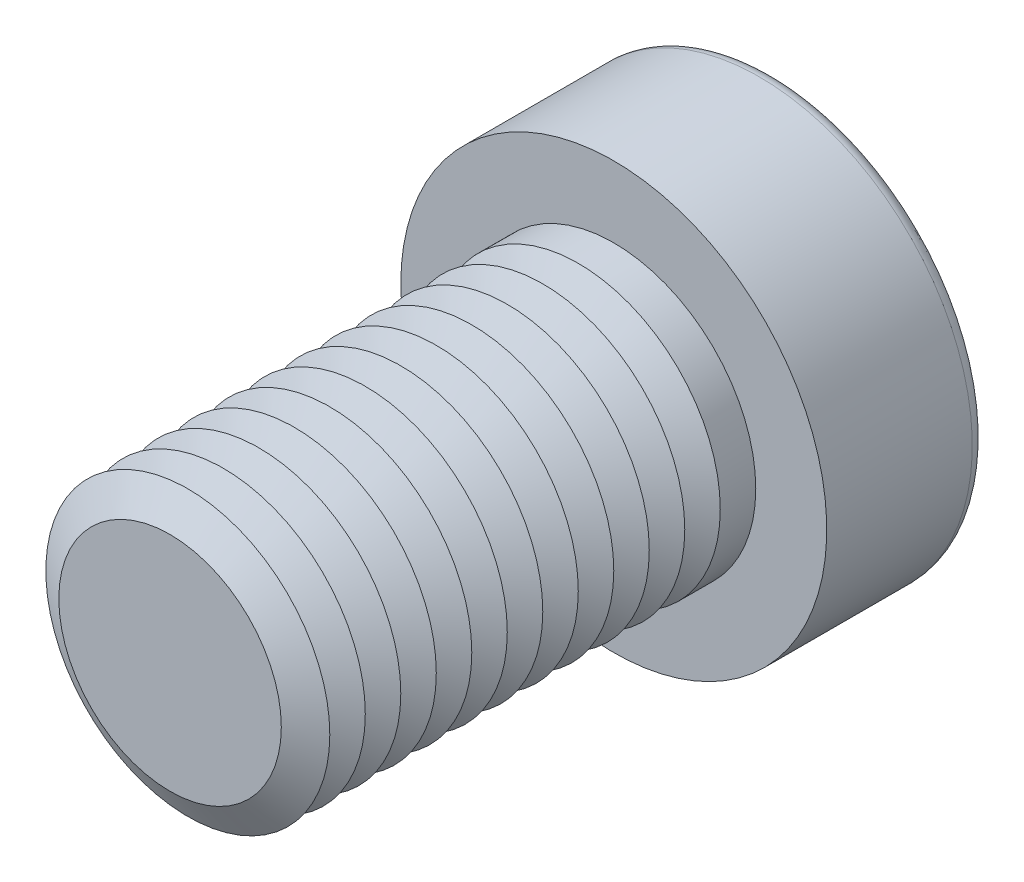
ISO-10303-21;
HEADER;
FILE_DESCRIPTION(('STEP AP214'),'2;1');
FILE_NAME('part.step','',(''),(''),'','','');
FILE_SCHEMA(('AUTOMOTIVE_DESIGN { 1 0 10303 214 1 1 1 1 }'));
ENDSEC;
DATA;
#1=APPLICATION_CONTEXT('core data for automotive mechanical design processes');
#2=APPLICATION_PROTOCOL_DEFINITION('international standard','automotive_design',2000,#1);
#3=PRODUCT_CONTEXT('',#1,'mechanical');
#4=PRODUCT('Part','Part','',(#3));
#5=PRODUCT_RELATED_PRODUCT_CATEGORY('part','',(#4));
#6=PRODUCT_DEFINITION_FORMATION('','',#4);
#7=PRODUCT_DEFINITION_CONTEXT('part definition',#1,'design');
#8=PRODUCT_DEFINITION('design','',#6,#7);
#9=PRODUCT_DEFINITION_SHAPE('','',#8);
#10=(LENGTH_UNIT() NAMED_UNIT(*) SI_UNIT(.MILLI.,.METRE.));
#11=(NAMED_UNIT(*) PLANE_ANGLE_UNIT() SI_UNIT($,.RADIAN.));
#12=(NAMED_UNIT(*) SI_UNIT($,.STERADIAN.) SOLID_ANGLE_UNIT());
#13=UNCERTAINTY_MEASURE_WITH_UNIT(LENGTH_MEASURE(1.E-05),#10,'distance_accuracy_value','');
#14=(GEOMETRIC_REPRESENTATION_CONTEXT(3) GLOBAL_UNCERTAINTY_ASSIGNED_CONTEXT((#13)) GLOBAL_UNIT_ASSIGNED_CONTEXT((#10,
#11,#12)) REPRESENTATION_CONTEXT('',''));
#15=CARTESIAN_POINT('',(0.,0.,0.));
#16=DIRECTION('',(0.,0.,1.));
#17=DIRECTION('',(1.,0.,0.));
#18=AXIS2_PLACEMENT_3D('',#15,#16,#17);
#19=CARTESIAN_POINT('',(0.,0.,18.));
#20=DIRECTION('',(0.,0.,1.));
#21=DIRECTION('',(1.,0.,0.));
#22=AXIS2_PLACEMENT_3D('',#19,#20,#21);
#23=CONICAL_SURFACE('',#22,8.,1.0471975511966);
#24=CARTESIAN_POINT('',(0.,0.,17.));
#25=DIRECTION('',(0.,0.,1.));
#26=DIRECTION('',(1.,0.,0.));
#27=AXIS2_PLACEMENT_3D('',#24,#25,#26);
#28=CIRCLE('',#27,6.26794919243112);
#29=CARTESIAN_POINT('',(6.26794919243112,0.,17.));
#30=VERTEX_POINT('',#29);
#31=EDGE_CURVE('E312',#30,#30,#28,.T.);
#32=ORIENTED_EDGE('',*,*,#31,.T.);
#33=EDGE_LOOP('',(#32));
#34=FACE_BOUND('',#33,.T.);
#35=CARTESIAN_POINT('',(0.,0.,18.));
#36=DIRECTION('',(0.,0.,1.));
#37=DIRECTION('',(1.,0.,0.));
#38=AXIS2_PLACEMENT_3D('',#35,#36,#37);
#39=CIRCLE('',#38,8.);
#40=CARTESIAN_POINT('',(8.,0.,18.));
#41=VERTEX_POINT('',#40);
#42=EDGE_CURVE('E315',#41,#41,#39,.T.);
#43=ORIENTED_EDGE('',*,*,#42,.F.);
#44=EDGE_LOOP('',(#43));
#45=FACE_BOUND('',#44,.T.);
#46=ADVANCED_FACE('F39',(#34,#45),#23,.T.);
#47=CARTESIAN_POINT('',(0.,0.,17.));
#48=DIRECTION('',(0.,0.,-1.));
#49=DIRECTION('',(-1.,0.,0.));
#50=AXIS2_PLACEMENT_3D('',#47,#48,#49);
#51=CONICAL_SURFACE('',#50,6.26794919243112,1.0471975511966);
#52=CARTESIAN_POINT('',(0.,0.,16.));
#53=DIRECTION('',(0.,0.,1.));
#54=DIRECTION('',(1.,0.,0.));
#55=AXIS2_PLACEMENT_3D('',#52,#53,#54);
#56=CIRCLE('',#55,8.);
#57=CARTESIAN_POINT('',(8.,0.,16.));
#58=VERTEX_POINT('',#57);
#59=EDGE_CURVE('E323',#58,#58,#56,.T.);
#60=ORIENTED_EDGE('',*,*,#59,.T.);
#61=EDGE_LOOP('',(#60));
#62=FACE_BOUND('',#61,.T.);
#63=ORIENTED_EDGE('',*,*,#31,.F.);
#64=EDGE_LOOP('',(#63));
#65=FACE_BOUND('',#64,.T.);
#66=ADVANCED_FACE('F244',(#62,#65),#51,.T.);
#67=CARTESIAN_POINT('',(0.,0.,25.));
#68=DIRECTION('',(0.,0.,1.));
#69=DIRECTION('',(1.,0.,0.));
#70=AXIS2_PLACEMENT_3D('',#67,#68,#69);
#71=PLANE('',#70);
#72=CARTESIAN_POINT('',(0.,0.,25.));
#73=DIRECTION('',(0.,0.,1.));
#74=DIRECTION('',(1.,0.,0.));
#75=AXIS2_PLACEMENT_3D('',#72,#73,#74);
#76=CIRCLE('',#75,6.26794919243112);
#77=CARTESIAN_POINT('',(6.26794919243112,0.,25.));
#78=VERTEX_POINT('',#77);
#79=EDGE_CURVE('E173',#78,#78,#76,.T.);
#80=ORIENTED_EDGE('',*,*,#79,.T.);
#81=EDGE_LOOP('',(#80));
#82=FACE_BOUND('',#81,.T.);
#83=ADVANCED_FACE('F250',(#82),#71,.T.);
#84=CARTESIAN_POINT('',(0.,0.,25.));
#85=DIRECTION('',(0.,0.,-1.));
#86=DIRECTION('',(-1.,0.,0.));
#87=AXIS2_PLACEMENT_3D('',#84,#85,#86);
#88=CONICAL_SURFACE('',#87,6.26794919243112,1.0471975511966);
#89=CARTESIAN_POINT('',(0.,0.,24.));
#90=DIRECTION('',(0.,0.,1.));
#91=DIRECTION('',(1.,0.,0.));
#92=AXIS2_PLACEMENT_3D('',#89,#90,#91);
#93=CIRCLE('',#92,8.);
#94=CARTESIAN_POINT('',(8.,0.,24.));
#95=VERTEX_POINT('',#94);
#96=EDGE_CURVE('E290',#95,#95,#93,.T.);
#97=ORIENTED_EDGE('',*,*,#96,.T.);
#98=EDGE_LOOP('',(#97));
#99=FACE_BOUND('',#98,.T.);
#100=ORIENTED_EDGE('',*,*,#79,.F.);
#101=EDGE_LOOP('',(#100));
#102=FACE_BOUND('',#101,.T.);
#103=ADVANCED_FACE('F198',(#99,#102),#88,.T.);
#104=CARTESIAN_POINT('',(0.,0.,24.));
#105=DIRECTION('',(0.,0.,1.));
#106=DIRECTION('',(1.,0.,0.));
#107=AXIS2_PLACEMENT_3D('',#104,#105,#106);
#108=CONICAL_SURFACE('',#107,8.,1.0471975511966);
#109=CARTESIAN_POINT('',(0.,0.,23.));
#110=DIRECTION('',(0.,0.,1.));
#111=DIRECTION('',(1.,0.,0.));
#112=AXIS2_PLACEMENT_3D('',#109,#110,#111);
#113=CIRCLE('',#112,6.26794919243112);
#114=CARTESIAN_POINT('',(6.26794919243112,0.,23.));
#115=VERTEX_POINT('',#114);
#116=EDGE_CURVE('E287',#115,#115,#113,.T.);
#117=ORIENTED_EDGE('',*,*,#116,.T.);
#118=EDGE_LOOP('',(#117));
#119=FACE_BOUND('',#118,.T.);
#120=ORIENTED_EDGE('',*,*,#96,.F.);
#121=EDGE_LOOP('',(#120));
#122=FACE_BOUND('',#121,.T.);
#123=ADVANCED_FACE('F276',(#119,#122),#108,.T.);
#124=CARTESIAN_POINT('',(0.,0.,23.));
#125=DIRECTION('',(0.,0.,-1.));
#126=DIRECTION('',(-1.,0.,0.));
#127=AXIS2_PLACEMENT_3D('',#124,#125,#126);
#128=CONICAL_SURFACE('',#127,6.26794919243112,1.0471975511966);
#129=CARTESIAN_POINT('',(0.,0.,22.));
#130=DIRECTION('',(0.,0.,1.));
#131=DIRECTION('',(1.,0.,0.));
#132=AXIS2_PLACEMENT_3D('',#129,#130,#131);
#133=CIRCLE('',#132,8.);
#134=CARTESIAN_POINT('',(8.,0.,22.));
#135=VERTEX_POINT('',#134);
#136=EDGE_CURVE('E299',#135,#135,#133,.T.);
#137=ORIENTED_EDGE('',*,*,#136,.T.);
#138=EDGE_LOOP('',(#137));
#139=FACE_BOUND('',#138,.T.);
#140=ORIENTED_EDGE('',*,*,#116,.F.);
#141=EDGE_LOOP('',(#140));
#142=FACE_BOUND('',#141,.T.);
#143=ADVANCED_FACE('F273',(#139,#142),#128,.T.);
#144=CARTESIAN_POINT('',(0.,0.,22.));
#145=DIRECTION('',(0.,0.,1.));
#146=DIRECTION('',(1.,0.,0.));
#147=AXIS2_PLACEMENT_3D('',#144,#145,#146);
#148=CONICAL_SURFACE('',#147,8.,1.0471975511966);
#149=CARTESIAN_POINT('',(0.,0.,21.));
#150=DIRECTION('',(0.,0.,1.));
#151=DIRECTION('',(1.,0.,0.));
#152=AXIS2_PLACEMENT_3D('',#149,#150,#151);
#153=CIRCLE('',#152,6.26794919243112);
#154=CARTESIAN_POINT('',(6.26794919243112,0.,21.));
#155=VERTEX_POINT('',#154);
#156=EDGE_CURVE('E292',#155,#155,#153,.T.);
#157=ORIENTED_EDGE('',*,*,#156,.T.);
#158=EDGE_LOOP('',(#157));
#159=FACE_BOUND('',#158,.T.);
#160=ORIENTED_EDGE('',*,*,#136,.F.);
#161=EDGE_LOOP('',(#160));
#162=FACE_BOUND('',#161,.T.);
#163=ADVANCED_FACE('F269',(#159,#162),#148,.T.);
#164=CARTESIAN_POINT('',(0.,0.,21.));
#165=DIRECTION('',(0.,0.,-1.));
#166=DIRECTION('',(-1.,0.,0.));
#167=AXIS2_PLACEMENT_3D('',#164,#165,#166);
#168=CONICAL_SURFACE('',#167,6.26794919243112,1.0471975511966);
#169=CARTESIAN_POINT('',(0.,0.,20.));
#170=DIRECTION('',(0.,0.,1.));
#171=DIRECTION('',(1.,0.,0.));
#172=AXIS2_PLACEMENT_3D('',#169,#170,#171);
#173=CIRCLE('',#172,8.);
#174=CARTESIAN_POINT('',(8.,0.,20.));
#175=VERTEX_POINT('',#174);
#176=EDGE_CURVE('E308',#175,#175,#173,.T.);
#177=ORIENTED_EDGE('',*,*,#176,.T.);
#178=EDGE_LOOP('',(#177));
#179=FACE_BOUND('',#178,.T.);
#180=ORIENTED_EDGE('',*,*,#156,.F.);
#181=EDGE_LOOP('',(#180));
#182=FACE_BOUND('',#181,.T.);
#183=ADVANCED_FACE('F265',(#179,#182),#168,.T.);
#184=CARTESIAN_POINT('',(0.,0.,20.));
#185=DIRECTION('',(0.,0.,1.));
#186=DIRECTION('',(1.,0.,0.));
#187=AXIS2_PLACEMENT_3D('',#184,#185,#186);
#188=CONICAL_SURFACE('',#187,8.,1.0471975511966);
#189=CARTESIAN_POINT('',(0.,0.,19.));
#190=DIRECTION('',(0.,0.,1.));
#191=DIRECTION('',(1.,0.,0.));
#192=AXIS2_PLACEMENT_3D('',#189,#190,#191);
#193=CIRCLE('',#192,6.26794919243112);
#194=CARTESIAN_POINT('',(6.26794919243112,0.,19.));
#195=VERTEX_POINT('',#194);
#196=EDGE_CURVE('E305',#195,#195,#193,.T.);
#197=ORIENTED_EDGE('',*,*,#196,.T.);
#198=EDGE_LOOP('',(#197));
#199=FACE_BOUND('',#198,.T.);
#200=ORIENTED_EDGE('',*,*,#176,.F.);
#201=EDGE_LOOP('',(#200));
#202=FACE_BOUND('',#201,.T.);
#203=ADVANCED_FACE('F261',(#199,#202),#188,.T.);
#204=CARTESIAN_POINT('',(0.,0.,19.));
#205=DIRECTION('',(0.,0.,-1.));
#206=DIRECTION('',(-1.,0.,0.));
#207=AXIS2_PLACEMENT_3D('',#204,#205,#206);
#208=CONICAL_SURFACE('',#207,6.26794919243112,1.0471975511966);
#209=ORIENTED_EDGE('',*,*,#42,.T.);
#210=EDGE_LOOP('',(#209));
#211=FACE_BOUND('',#210,.T.);
#212=ORIENTED_EDGE('',*,*,#196,.F.);
#213=EDGE_LOOP('',(#212));
#214=FACE_BOUND('',#213,.T.);
#215=ADVANCED_FACE('F257',(#211,#214),#208,.T.);
#216=CARTESIAN_POINT('',(0.,0.,16.));
#217=DIRECTION('',(0.,0.,1.));
#218=DIRECTION('',(1.,0.,0.));
#219=AXIS2_PLACEMENT_3D('',#216,#217,#218);
#220=CONICAL_SURFACE('',#219,8.,1.0471975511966);
#221=CARTESIAN_POINT('',(0.,0.,15.));
#222=DIRECTION('',(0.,0.,1.));
#223=DIRECTION('',(1.,0.,0.));
#224=AXIS2_PLACEMENT_3D('',#221,#222,#223);
#225=CIRCLE('',#224,6.26794919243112);
#226=CARTESIAN_POINT('',(6.26794919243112,0.,15.));
#227=VERTEX_POINT('',#226);
#228=EDGE_CURVE('E319',#227,#227,#225,.T.);
#229=ORIENTED_EDGE('',*,*,#228,.T.);
#230=EDGE_LOOP('',(#229));
#231=FACE_BOUND('',#230,.T.);
#232=ORIENTED_EDGE('',*,*,#59,.F.);
#233=EDGE_LOOP('',(#232));
#234=FACE_BOUND('',#233,.T.);
#235=ADVANCED_FACE('F260',(#231,#234),#220,.T.);
#236=CARTESIAN_POINT('',(0.,0.,15.));
#237=DIRECTION('',(0.,0.,-1.));
#238=DIRECTION('',(-1.,0.,0.));
#239=AXIS2_PLACEMENT_3D('',#236,#237,#238);
#240=CONICAL_SURFACE('',#239,6.26794919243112,1.0471975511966);
#241=CARTESIAN_POINT('',(0.,0.,14.));
#242=DIRECTION('',(0.,0.,1.));
#243=DIRECTION('',(1.,0.,0.));
#244=AXIS2_PLACEMENT_3D('',#241,#242,#243);
#245=CIRCLE('',#244,8.);
#246=CARTESIAN_POINT('',(8.,0.,14.));
#247=VERTEX_POINT('',#246);
#248=EDGE_CURVE('E331',#247,#247,#245,.T.);
#249=ORIENTED_EDGE('',*,*,#248,.T.);
#250=EDGE_LOOP('',(#249));
#251=FACE_BOUND('',#250,.T.);
#252=ORIENTED_EDGE('',*,*,#228,.F.);
#253=EDGE_LOOP('',(#252));
#254=FACE_BOUND('',#253,.T.);
#255=ADVANCED_FACE('F431',(#251,#254),#240,.T.);
#256=CARTESIAN_POINT('',(0.,0.,14.));
#257=DIRECTION('',(0.,0.,1.));
#258=DIRECTION('',(1.,0.,0.));
#259=AXIS2_PLACEMENT_3D('',#256,#257,#258);
#260=CONICAL_SURFACE('',#259,8.,1.0471975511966);
#261=CARTESIAN_POINT('',(0.,0.,13.));
#262=DIRECTION('',(0.,0.,1.));
#263=DIRECTION('',(1.,0.,0.));
#264=AXIS2_PLACEMENT_3D('',#261,#262,#263);
#265=CIRCLE('',#264,6.26794919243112);
#266=CARTESIAN_POINT('',(6.26794919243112,0.,13.));
#267=VERTEX_POINT('',#266);
#268=EDGE_CURVE('E327',#267,#267,#265,.T.);
#269=ORIENTED_EDGE('',*,*,#268,.T.);
#270=EDGE_LOOP('',(#269));
#271=FACE_BOUND('',#270,.T.);
#272=ORIENTED_EDGE('',*,*,#248,.F.);
#273=EDGE_LOOP('',(#272));
#274=FACE_BOUND('',#273,.T.);
#275=ADVANCED_FACE('F427',(#271,#274),#260,.T.);
#276=CARTESIAN_POINT('',(0.,0.,13.));
#277=DIRECTION('',(0.,0.,-1.));
#278=DIRECTION('',(-1.,0.,0.));
#279=AXIS2_PLACEMENT_3D('',#276,#277,#278);
#280=CONICAL_SURFACE('',#279,6.26794919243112,1.0471975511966);
#281=CARTESIAN_POINT('',(0.,0.,12.));
#282=DIRECTION('',(0.,0.,1.));
#283=DIRECTION('',(1.,0.,0.));
#284=AXIS2_PLACEMENT_3D('',#281,#282,#283);
#285=CIRCLE('',#284,8.);
#286=CARTESIAN_POINT('',(8.,0.,12.));
#287=VERTEX_POINT('',#286);
#288=EDGE_CURVE('E339',#287,#287,#285,.T.);
#289=ORIENTED_EDGE('',*,*,#288,.T.);
#290=EDGE_LOOP('',(#289));
#291=FACE_BOUND('',#290,.T.);
#292=ORIENTED_EDGE('',*,*,#268,.F.);
#293=EDGE_LOOP('',(#292));
#294=FACE_BOUND('',#293,.T.);
#295=ADVANCED_FACE('F423',(#291,#294),#280,.T.);
#296=CARTESIAN_POINT('',(0.,0.,12.));
#297=DIRECTION('',(0.,0.,1.));
#298=DIRECTION('',(1.,0.,0.));
#299=AXIS2_PLACEMENT_3D('',#296,#297,#298);
#300=CONICAL_SURFACE('',#299,8.,1.0471975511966);
#301=CARTESIAN_POINT('',(0.,0.,11.));
#302=DIRECTION('',(0.,0.,1.));
#303=DIRECTION('',(1.,0.,0.));
#304=AXIS2_PLACEMENT_3D('',#301,#302,#303);
#305=CIRCLE('',#304,6.26794919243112);
#306=CARTESIAN_POINT('',(6.26794919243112,0.,11.));
#307=VERTEX_POINT('',#306);
#308=EDGE_CURVE('E335',#307,#307,#305,.T.);
#309=ORIENTED_EDGE('',*,*,#308,.T.);
#310=EDGE_LOOP('',(#309));
#311=FACE_BOUND('',#310,.T.);
#312=ORIENTED_EDGE('',*,*,#288,.F.);
#313=EDGE_LOOP('',(#312));
#314=FACE_BOUND('',#313,.T.);
#315=ADVANCED_FACE('F419',(#311,#314),#300,.T.);
#316=CARTESIAN_POINT('',(0.,0.,11.));
#317=DIRECTION('',(0.,0.,-1.));
#318=DIRECTION('',(-1.,0.,0.));
#319=AXIS2_PLACEMENT_3D('',#316,#317,#318);
#320=CONICAL_SURFACE('',#319,6.26794919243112,1.0471975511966);
#321=CARTESIAN_POINT('',(0.,0.,9.99999999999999));
#322=DIRECTION('',(0.,0.,1.));
#323=DIRECTION('',(1.,0.,0.));
#324=AXIS2_PLACEMENT_3D('',#321,#322,#323);
#325=CIRCLE('',#324,8.);
#326=CARTESIAN_POINT('',(8.,0.,9.99999999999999));
#327=VERTEX_POINT('',#326);
#328=EDGE_CURVE('E347',#327,#327,#325,.T.);
#329=ORIENTED_EDGE('',*,*,#328,.T.);
#330=EDGE_LOOP('',(#329));
#331=FACE_BOUND('',#330,.T.);
#332=ORIENTED_EDGE('',*,*,#308,.F.);
#333=EDGE_LOOP('',(#332));
#334=FACE_BOUND('',#333,.T.);
#335=ADVANCED_FACE('F415',(#331,#334),#320,.T.);
#336=CARTESIAN_POINT('',(0.,0.,9.99999999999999));
#337=DIRECTION('',(0.,0.,1.));
#338=DIRECTION('',(1.,0.,0.));
#339=AXIS2_PLACEMENT_3D('',#336,#337,#338);
#340=CONICAL_SURFACE('',#339,8.,1.0471975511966);
#341=CARTESIAN_POINT('',(0.,0.,8.99999999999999));
#342=DIRECTION('',(0.,0.,1.));
#343=DIRECTION('',(1.,0.,0.));
#344=AXIS2_PLACEMENT_3D('',#341,#342,#343);
#345=CIRCLE('',#344,6.26794919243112);
#346=CARTESIAN_POINT('',(6.26794919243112,0.,8.99999999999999));
#347=VERTEX_POINT('',#346);
#348=EDGE_CURVE('E343',#347,#347,#345,.T.);
#349=ORIENTED_EDGE('',*,*,#348,.T.);
#350=EDGE_LOOP('',(#349));
#351=FACE_BOUND('',#350,.T.);
#352=ORIENTED_EDGE('',*,*,#328,.F.);
#353=EDGE_LOOP('',(#352));
#354=FACE_BOUND('',#353,.T.);
#355=ADVANCED_FACE('F411',(#351,#354),#340,.T.);
#356=CARTESIAN_POINT('',(0.,0.,8.99999999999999));
#357=DIRECTION('',(0.,0.,-1.));
#358=DIRECTION('',(-1.,0.,0.));
#359=AXIS2_PLACEMENT_3D('',#356,#357,#358);
#360=CONICAL_SURFACE('',#359,6.26794919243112,1.0471975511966);
#361=CARTESIAN_POINT('',(0.,0.,7.99999999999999));
#362=DIRECTION('',(0.,0.,1.));
#363=DIRECTION('',(1.,0.,0.));
#364=AXIS2_PLACEMENT_3D('',#361,#362,#363);
#365=CIRCLE('',#364,8.);
#366=CARTESIAN_POINT('',(8.,0.,7.99999999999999));
#367=VERTEX_POINT('',#366);
#368=EDGE_CURVE('E355',#367,#367,#365,.T.);
#369=ORIENTED_EDGE('',*,*,#368,.T.);
#370=EDGE_LOOP('',(#369));
#371=FACE_BOUND('',#370,.T.);
#372=ORIENTED_EDGE('',*,*,#348,.F.);
#373=EDGE_LOOP('',(#372));
#374=FACE_BOUND('',#373,.T.);
#375=ADVANCED_FACE('F407',(#371,#374),#360,.T.);
#376=CARTESIAN_POINT('',(0.,0.,7.99999999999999));
#377=DIRECTION('',(0.,0.,1.));
#378=DIRECTION('',(1.,0.,0.));
#379=AXIS2_PLACEMENT_3D('',#376,#377,#378);
#380=CONICAL_SURFACE('',#379,8.,1.0471975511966);
#381=CARTESIAN_POINT('',(0.,0.,6.99999999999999));
#382=DIRECTION('',(0.,0.,1.));
#383=DIRECTION('',(1.,0.,0.));
#384=AXIS2_PLACEMENT_3D('',#381,#382,#383);
#385=CIRCLE('',#384,6.26794919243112);
#386=CARTESIAN_POINT('',(6.26794919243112,0.,6.99999999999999));
#387=VERTEX_POINT('',#386);
#388=EDGE_CURVE('E351',#387,#387,#385,.T.);
#389=ORIENTED_EDGE('',*,*,#388,.T.);
#390=EDGE_LOOP('',(#389));
#391=FACE_BOUND('',#390,.T.);
#392=ORIENTED_EDGE('',*,*,#368,.F.);
#393=EDGE_LOOP('',(#392));
#394=FACE_BOUND('',#393,.T.);
#395=ADVANCED_FACE('F403',(#391,#394),#380,.T.);
#396=CARTESIAN_POINT('',(0.,0.,6.99999999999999));
#397=DIRECTION('',(0.,0.,-1.));
#398=DIRECTION('',(-1.,0.,0.));
#399=AXIS2_PLACEMENT_3D('',#396,#397,#398);
#400=CONICAL_SURFACE('',#399,6.26794919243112,1.0471975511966);
#401=CARTESIAN_POINT('',(0.,0.,5.99999999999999));
#402=DIRECTION('',(0.,0.,1.));
#403=DIRECTION('',(1.,0.,0.));
#404=AXIS2_PLACEMENT_3D('',#401,#402,#403);
#405=CIRCLE('',#404,8.);
#406=CARTESIAN_POINT('',(8.,0.,5.99999999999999));
#407=VERTEX_POINT('',#406);
#408=EDGE_CURVE('E363',#407,#407,#405,.T.);
#409=ORIENTED_EDGE('',*,*,#408,.T.);
#410=EDGE_LOOP('',(#409));
#411=FACE_BOUND('',#410,.T.);
#412=ORIENTED_EDGE('',*,*,#388,.F.);
#413=EDGE_LOOP('',(#412));
#414=FACE_BOUND('',#413,.T.);
#415=ADVANCED_FACE('F399',(#411,#414),#400,.T.);
#416=CARTESIAN_POINT('',(0.,0.,5.99999999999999));
#417=DIRECTION('',(0.,0.,1.));
#418=DIRECTION('',(1.,0.,0.));
#419=AXIS2_PLACEMENT_3D('',#416,#417,#418);
#420=CONICAL_SURFACE('',#419,8.,1.0471975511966);
#421=CARTESIAN_POINT('',(0.,0.,4.99999999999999));
#422=DIRECTION('',(0.,0.,1.));
#423=DIRECTION('',(1.,0.,0.));
#424=AXIS2_PLACEMENT_3D('',#421,#422,#423);
#425=CIRCLE('',#424,6.26794919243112);
#426=CARTESIAN_POINT('',(6.26794919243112,0.,4.99999999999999));
#427=VERTEX_POINT('',#426);
#428=EDGE_CURVE('E359',#427,#427,#425,.T.);
#429=ORIENTED_EDGE('',*,*,#428,.T.);
#430=EDGE_LOOP('',(#429));
#431=FACE_BOUND('',#430,.T.);
#432=ORIENTED_EDGE('',*,*,#408,.F.);
#433=EDGE_LOOP('',(#432));
#434=FACE_BOUND('',#433,.T.);
#435=ADVANCED_FACE('F394',(#431,#434),#420,.T.);
#436=CARTESIAN_POINT('',(0.,0.,4.99999999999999));
#437=DIRECTION('',(0.,0.,-1.));
#438=DIRECTION('',(-1.,0.,0.));
#439=AXIS2_PLACEMENT_3D('',#436,#437,#438);
#440=CONICAL_SURFACE('',#439,6.26794919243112,1.0471975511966);
#441=CARTESIAN_POINT('',(0.,0.,4.));
#442=DIRECTION('',(0.,0.,1.));
#443=DIRECTION('',(1.,0.,0.));
#444=AXIS2_PLACEMENT_3D('',#441,#442,#443);
#445=CIRCLE('',#444,8.);
#446=CARTESIAN_POINT('',(8.,0.,4.));
#447=VERTEX_POINT('',#446);
#448=EDGE_CURVE('E375',#447,#447,#445,.T.);
#449=ORIENTED_EDGE('',*,*,#448,.T.);
#450=EDGE_LOOP('',(#449));
#451=FACE_BOUND('',#450,.T.);
#452=ORIENTED_EDGE('',*,*,#428,.F.);
#453=EDGE_LOOP('',(#452));
#454=FACE_BOUND('',#453,.T.);
#455=ADVANCED_FACE('F380',(#451,#454),#440,.T.);
#456=CARTESIAN_POINT('',(0.,0.,4.));
#457=DIRECTION('',(0.,0.,1.));
#458=DIRECTION('',(1.,0.,0.));
#459=AXIS2_PLACEMENT_3D('',#456,#457,#458);
#460=CONICAL_SURFACE('',#459,8.,1.0471975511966);
#461=CARTESIAN_POINT('',(0.,0.,3.));
#462=DIRECTION('',(0.,0.,1.));
#463=DIRECTION('',(1.,0.,0.));
#464=AXIS2_PLACEMENT_3D('',#461,#462,#463);
#465=CIRCLE('',#464,6.26794919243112);
#466=CARTESIAN_POINT('',(6.26794919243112,0.,3.));
#467=VERTEX_POINT('',#466);
#468=EDGE_CURVE('E367',#467,#467,#465,.T.);
#469=ORIENTED_EDGE('',*,*,#468,.T.);
#470=EDGE_LOOP('',(#469));
#471=FACE_BOUND('',#470,.T.);
#472=ORIENTED_EDGE('',*,*,#448,.F.);
#473=EDGE_LOOP('',(#472));
#474=FACE_BOUND('',#473,.T.);
#475=ADVANCED_FACE('F383',(#471,#474),#460,.T.);
#476=CARTESIAN_POINT('',(0.,0.,3.));
#477=DIRECTION('',(0.,0.,-1.));
#478=DIRECTION('',(-1.,0.,0.));
#479=AXIS2_PLACEMENT_3D('',#476,#477,#478);
#480=CONICAL_SURFACE('',#479,6.26794919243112,1.0471975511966);
#481=CARTESIAN_POINT('',(0.,0.,1.99999999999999));
#482=DIRECTION('',(0.,0.,1.));
#483=DIRECTION('',(1.,0.,0.));
#484=AXIS2_PLACEMENT_3D('',#481,#482,#483);
#485=CIRCLE('',#484,8.);
#486=CARTESIAN_POINT('',(8.,0.,1.99999999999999));
#487=VERTEX_POINT('',#486);
#488=EDGE_CURVE('E371',#487,#487,#485,.T.);
#489=ORIENTED_EDGE('',*,*,#488,.T.);
#490=EDGE_LOOP('',(#489));
#491=FACE_BOUND('',#490,.T.);
#492=ORIENTED_EDGE('',*,*,#468,.F.);
#493=EDGE_LOOP('',(#492));
#494=FACE_BOUND('',#493,.T.);
#495=ADVANCED_FACE('F385',(#491,#494),#480,.T.);
#496=CARTESIAN_POINT('',(0.,0.,0.));
#497=DIRECTION('',(0.,0.,-1.));
#498=DIRECTION('',(-1.,0.,0.));
#499=AXIS2_PLACEMENT_3D('',#496,#497,#498);
#500=CONICAL_SURFACE('',#499,6.,1.0471975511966);
#501=CARTESIAN_POINT('',(0.,0.,3.46410161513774));
#502=VERTEX_POINT('',#501);
#503=VERTEX_LOOP('',#502);
#504=FACE_BOUND('',#503,.T.);
#505=CARTESIAN_POINT('',(0.,0.,0.));
#506=DIRECTION('',(0.,0.,-1.));
#507=DIRECTION('',(-1.,0.,0.));
#508=AXIS2_PLACEMENT_3D('',#505,#506,#507);
#509=CIRCLE('',#508,6.);
#510=CARTESIAN_POINT('',(-5.19615242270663,3.,0.));
#511=VERTEX_POINT('',#510);
#512=CARTESIAN_POINT('',(0.,6.,0.));
#513=VERTEX_POINT('',#512);
#514=EDGE_CURVE('E149',#511,#513,#509,.T.);
#515=ORIENTED_EDGE('',*,*,#514,.T.);
#516=CARTESIAN_POINT('',(0.,0.,0.));
#517=DIRECTION('',(0.,0.,-1.));
#518=DIRECTION('',(-1.,0.,0.));
#519=AXIS2_PLACEMENT_3D('',#516,#517,#518);
#520=CIRCLE('',#519,6.);
#521=CARTESIAN_POINT('',(5.19615242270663,3.,0.));
#522=VERTEX_POINT('',#521);
#523=EDGE_CURVE('E54',#513,#522,#520,.T.);
#524=ORIENTED_EDGE('',*,*,#523,.T.);
#525=CARTESIAN_POINT('',(5.19615242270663,-3.,0.));
#526=VERTEX_POINT('',#525);
#527=EDGE_CURVE('E875',#522,#526,#520,.T.);
#528=ORIENTED_EDGE('',*,*,#527,.T.);
#529=CARTESIAN_POINT('',(0.,-6.,0.));
#530=VERTEX_POINT('',#529);
#531=EDGE_CURVE('E873',#526,#530,#520,.T.);
#532=ORIENTED_EDGE('',*,*,#531,.T.);
#533=CARTESIAN_POINT('',(-5.19615242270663,-3.,0.));
#534=VERTEX_POINT('',#533);
#535=EDGE_CURVE('E868',#530,#534,#520,.T.);
#536=ORIENTED_EDGE('',*,*,#535,.T.);
#537=EDGE_CURVE('E866',#534,#511,#520,.T.);
#538=ORIENTED_EDGE('',*,*,#537,.T.);
#539=EDGE_LOOP('',(#515,#524,#528,#532,#536,#538));
#540=FACE_BOUND('',#539,.T.);
#541=ADVANCED_FACE('F200',(#504,#540),#500,.F.);
#542=CARTESIAN_POINT('',(0.,0.,0.));
#543=DIRECTION('',(0.,0.,-1.));
#544=DIRECTION('',(-1.,0.,0.));
#545=AXIS2_PLACEMENT_3D('',#542,#543,#544);
#546=PLANE('',#545);
#547=ORIENTED_EDGE('',*,*,#523,.F.);
#548=DIRECTION('',(1.,0.,0.));
#549=VECTOR('',#548,1.);
#550=CARTESIAN_POINT('',(-3.46410161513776,6.,0.));
#551=LINE('',#550,#549);
#552=CARTESIAN_POINT('',(3.46410161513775,6.,0.));
#553=VERTEX_POINT('',#552);
#554=EDGE_CURVE('E922',#513,#553,#551,.T.);
#555=ORIENTED_EDGE('',*,*,#554,.T.);
#556=DIRECTION('',(0.5,-0.866025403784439,0.));
#557=VECTOR('',#556,1.);
#558=CARTESIAN_POINT('',(3.46410161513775,6.,0.));
#559=LINE('',#558,#557);
#560=EDGE_CURVE('E155',#553,#522,#559,.T.);
#561=ORIENTED_EDGE('',*,*,#560,.T.);
#562=EDGE_LOOP('',(#547,#555,#561));
#563=FACE_BOUND('',#562,.T.);
#564=ADVANCED_FACE('F496',(#563),#546,.T.);
#565=ORIENTED_EDGE('',*,*,#527,.F.);
#566=CARTESIAN_POINT('',(6.92820323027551,0.,0.));
#567=VERTEX_POINT('',#566);
#568=EDGE_CURVE('E916',#522,#567,#559,.T.);
#569=ORIENTED_EDGE('',*,*,#568,.T.);
#570=DIRECTION('',(-0.5,-0.866025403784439,0.));
#571=VECTOR('',#570,1.);
#572=CARTESIAN_POINT('',(6.92820323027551,0.,0.));
#573=LINE('',#572,#571);
#574=EDGE_CURVE('E890',#567,#526,#573,.T.);
#575=ORIENTED_EDGE('',*,*,#574,.T.);
#576=EDGE_LOOP('',(#565,#569,#575));
#577=FACE_BOUND('',#576,.T.);
#578=ADVANCED_FACE('F506',(#577),#546,.T.);
#579=ORIENTED_EDGE('',*,*,#531,.F.);
#580=CARTESIAN_POINT('',(3.46410161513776,-6.,0.));
#581=VERTEX_POINT('',#580);
#582=EDGE_CURVE('E892',#526,#581,#573,.T.);
#583=ORIENTED_EDGE('',*,*,#582,.T.);
#584=DIRECTION('',(-1.,0.,0.));
#585=VECTOR('',#584,1.);
#586=CARTESIAN_POINT('',(3.46410161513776,-6.,0.));
#587=LINE('',#586,#585);
#588=EDGE_CURVE('E842',#581,#530,#587,.T.);
#589=ORIENTED_EDGE('',*,*,#588,.T.);
#590=EDGE_LOOP('',(#579,#583,#589));
#591=FACE_BOUND('',#590,.T.);
#592=ADVANCED_FACE('F516',(#591),#546,.T.);
#593=ORIENTED_EDGE('',*,*,#535,.F.);
#594=CARTESIAN_POINT('',(-3.46410161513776,-6.,0.));
#595=VERTEX_POINT('',#594);
#596=EDGE_CURVE('E886',#530,#595,#587,.T.);
#597=ORIENTED_EDGE('',*,*,#596,.T.);
#598=DIRECTION('',(-0.5,0.866025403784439,0.));
#599=VECTOR('',#598,1.);
#600=CARTESIAN_POINT('',(-3.46410161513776,-6.,0.));
#601=LINE('',#600,#599);
#602=EDGE_CURVE('E888',#595,#534,#601,.T.);
#603=ORIENTED_EDGE('',*,*,#602,.T.);
#604=EDGE_LOOP('',(#593,#597,#603));
#605=FACE_BOUND('',#604,.T.);
#606=ADVANCED_FACE('F524',(#605),#546,.T.);
#607=ORIENTED_EDGE('',*,*,#537,.F.);
#608=CARTESIAN_POINT('',(-6.92820323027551,0.,0.));
#609=VERTEX_POINT('',#608);
#610=EDGE_CURVE('E894',#534,#609,#601,.T.);
#611=ORIENTED_EDGE('',*,*,#610,.T.);
#612=DIRECTION('',(0.5,0.866025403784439,0.));
#613=VECTOR('',#612,1.);
#614=CARTESIAN_POINT('',(-6.92820323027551,0.,0.));
#615=LINE('',#614,#613);
#616=EDGE_CURVE('E158',#609,#511,#615,.T.);
#617=ORIENTED_EDGE('',*,*,#616,.T.);
#618=EDGE_LOOP('',(#607,#611,#617));
#619=FACE_BOUND('',#618,.T.);
#620=ADVANCED_FACE('F230',(#619),#546,.T.);
#621=ORIENTED_EDGE('',*,*,#514,.F.);
#622=CARTESIAN_POINT('',(-3.46410161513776,6.,0.));
#623=VERTEX_POINT('',#622);
#624=EDGE_CURVE('E901',#511,#623,#615,.T.);
#625=ORIENTED_EDGE('',*,*,#624,.T.);
#626=EDGE_CURVE('E918',#623,#513,#551,.T.);
#627=ORIENTED_EDGE('',*,*,#626,.T.);
#628=EDGE_LOOP('',(#621,#625,#627));
#629=FACE_BOUND('',#628,.T.);
#630=ADVANCED_FACE('F508',(#629),#546,.T.);
#631=CARTESIAN_POINT('',(-3.46410161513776,6.,0.));
#632=DIRECTION('',(0.,1.,0.));
#633=DIRECTION('',(0.,0.,1.));
#634=AXIS2_PLACEMENT_3D('',#631,#632,#633);
#635=PLANE('',#634);
#636=DIRECTION('',(0.,0.,-1.));
#637=VECTOR('',#636,1.);
#638=CARTESIAN_POINT('',(-3.46410161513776,6.,0.));
#639=LINE('',#638,#637);
#640=CARTESIAN_POINT('',(-3.46410161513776,6.,-9.));
#641=VERTEX_POINT('',#640);
#642=EDGE_CURVE('E147',#623,#641,#639,.T.);
#643=ORIENTED_EDGE('',*,*,#642,.T.);
#644=CARTESIAN_POINT('',(-9.04322275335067,6.,-10.0515506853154));
#645=CARTESIAN_POINT('',(-8.77229389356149,6.,-9.99107568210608));
#646=CARTESIAN_POINT('',(-8.50119215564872,6.,-9.93136093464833));
#647=CARTESIAN_POINT('',(-7.95855825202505,6.,-9.81386229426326));
#648=CARTESIAN_POINT('',(-7.68702606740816,6.,-9.75607848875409));
#649=CARTESIAN_POINT('',(-7.14318995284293,6.,-9.64279905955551));
#650=CARTESIAN_POINT('',(-6.87088551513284,6.,-9.58730586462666));
#651=CARTESIAN_POINT('',(-6.32570082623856,6.,-9.47922577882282));
#652=CARTESIAN_POINT('',(-6.05282058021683,6.,-9.42663886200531));
#653=CARTESIAN_POINT('',(-5.50875458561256,6.,-9.32550177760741));
#654=CARTESIAN_POINT('',(-5.23757463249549,6.,-9.27692059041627));
#655=CARTESIAN_POINT('',(-4.69446863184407,6.,-9.18413302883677));
#656=CARTESIAN_POINT('',(-4.42254260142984,6.,-9.13992655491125));
#657=CARTESIAN_POINT('',(-3.87790333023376,6.,-9.05690830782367));
#658=CARTESIAN_POINT('',(-3.6051902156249,6.,-9.0180957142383));
#659=CARTESIAN_POINT('',(-3.05890080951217,6.,-8.94703062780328));
#660=CARTESIAN_POINT('',(-2.7853245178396,6.,-8.91477813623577));
#661=CARTESIAN_POINT('',(-2.23425545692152,6.,-8.85776959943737));
#662=CARTESIAN_POINT('',(-1.95675335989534,6.,-8.83310236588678));
#663=CARTESIAN_POINT('',(-1.40107824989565,6.,-8.79298360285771));
#664=CARTESIAN_POINT('',(-1.12290525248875,6.,-8.77753186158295));
#665=CARTESIAN_POINT('',(-0.566293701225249,6.,-8.75674610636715));
#666=CARTESIAN_POINT('',(-0.287855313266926,6.,-8.75140773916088));
#667=CARTESIAN_POINT('',(0.269026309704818,6.,-8.75117360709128));
#668=CARTESIAN_POINT('',(0.547469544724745,6.,-8.75627785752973));
#669=CARTESIAN_POINT('',(1.10511819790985,6.,-8.77664719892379));
#670=CARTESIAN_POINT('',(1.38432206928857,6.,-8.79195380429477));
#671=CARTESIAN_POINT('',(1.94205759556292,6.,-8.83187108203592));
#672=CARTESIAN_POINT('',(2.22058923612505,6.,-8.85648195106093));
#673=CARTESIAN_POINT('',(2.77698779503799,6.,-8.91379497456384));
#674=CARTESIAN_POINT('',(3.05485416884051,6.,-8.94650233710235));
#675=CARTESIAN_POINT('',(3.60969614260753,6.,-9.01868375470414));
#676=CARTESIAN_POINT('',(3.88667174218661,6.,-9.0581578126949));
#677=CARTESIAN_POINT('',(4.44700464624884,6.,-9.14374886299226));
#678=CARTESIAN_POINT('',(4.73033933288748,6.,-9.190012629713));
#679=CARTESIAN_POINT('',(5.29620685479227,6.,-9.28723184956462));
#680=CARTESIAN_POINT('',(5.57873966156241,6.,-9.3381874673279));
#681=CARTESIAN_POINT('',(6.14313105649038,6.,-9.44386031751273));
#682=CARTESIAN_POINT('',(6.42498956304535,6.,-9.49857798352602));
#683=CARTESIAN_POINT('',(6.98810511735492,6.,-9.61103289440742));
#684=CARTESIAN_POINT('',(7.26936215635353,6.,-9.66877018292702));
#685=CARTESIAN_POINT('',(8.11254995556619,6.,-9.84563705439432));
#686=CARTESIAN_POINT('',(8.67372006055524,6.,-9.96838761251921));
#687=CARTESIAN_POINT('',(9.79457370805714,6.,-10.2202420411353));
#688=CARTESIAN_POINT('',(10.3542573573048,6.,-10.3493454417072));
#689=CARTESIAN_POINT('',(11.4657945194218,6.,-10.6103395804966));
#690=CARTESIAN_POINT('',(12.0176605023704,6.,-10.7421773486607));
#691=CARTESIAN_POINT('',(13.1206665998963,6.,-11.0089002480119));
#692=CARTESIAN_POINT('',(13.6718066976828,6.,-11.1437854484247));
#693=CARTESIAN_POINT('',(14.7727697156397,6.,-11.4155878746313));
#694=CARTESIAN_POINT('',(15.3225934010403,6.,-11.5525020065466));
#695=CARTESIAN_POINT('',(16.4217957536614,6.,-11.8280226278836));
#696=CARTESIAN_POINT('',(16.971174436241,6.,-11.9666290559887));
#697=CARTESIAN_POINT('',(17.5204019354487,6.,-12.1058251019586));
#698=B_SPLINE_CURVE_WITH_KNOTS('',3,(#644,#645,#646,#647,#648,#649,#650,#651,#652,#653,#654,
#655,#656,#657,#658,#659,#660,#661,#662,#663,#664,#665,#666,#667,#668,#669,#670,#671,#672,#673,
#674,#675,#676,#677,#678,#679,#680,#681,#682,#683,#684,#685,#686,#687,#688,#689,#690,#691,#692,
#693,#694,#695,#696,#697),.UNSPECIFIED.,.F.,.F.,(4,2,2,2,2,2,2,2,2,2,2,2,2,2,2,2,2,2,2,2,2,2,2,
2,2,2,4),(0.,0.832792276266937,1.6656222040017,2.49931362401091,3.33299760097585,
4.15946050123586,4.98590459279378,5.81222284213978,6.63854125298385,7.47419540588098,
8.30983035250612,9.14510552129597,9.98038191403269,10.8190780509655,11.6577919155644,
12.4970466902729,13.336301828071,14.1975135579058,15.0587555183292,15.9200969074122,
16.7814507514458,18.5047000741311,20.2278221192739,21.929995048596,23.6322066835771,
25.3320460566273,27.0318240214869),.UNSPECIFIED.);
#699=CARTESIAN_POINT('',(3.46410161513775,6.,-9.));
#700=VERTEX_POINT('',#699);
#701=EDGE_CURVE('E124',#641,#700,#698,.T.);
#702=ORIENTED_EDGE('',*,*,#701,.T.);
#703=DIRECTION('',(0.,0.,-1.));
#704=VECTOR('',#703,1.);
#705=CARTESIAN_POINT('',(3.46410161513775,6.,0.));
#706=LINE('',#705,#704);
#707=EDGE_CURVE('E143',#553,#700,#706,.T.);
#708=ORIENTED_EDGE('',*,*,#707,.F.);
#709=ORIENTED_EDGE('',*,*,#554,.F.);
#710=ORIENTED_EDGE('',*,*,#626,.F.);
#711=EDGE_LOOP('',(#643,#702,#708,#709,#710));
#712=FACE_BOUND('',#711,.T.);
#713=ADVANCED_FACE('F141',(#712),#635,.F.);
#714=CARTESIAN_POINT('',(3.46410161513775,6.,0.));
#715=DIRECTION('',(0.866025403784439,0.5,0.));
#716=DIRECTION('',(-0.5,0.866025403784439,0.));
#717=AXIS2_PLACEMENT_3D('',#714,#715,#716);
#718=PLANE('',#717);
#719=ORIENTED_EDGE('',*,*,#707,.T.);
#720=CARTESIAN_POINT('',(3.46398614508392,6.0002,-9.00003094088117));
#721=CARTESIAN_POINT('',(3.60785114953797,5.75101850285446,-8.96146591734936));
#722=CARTESIAN_POINT('',(3.75197700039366,5.5013852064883,-8.92645521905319));
#723=CARTESIAN_POINT('',(4.0407377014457,5.00123700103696,-8.86494467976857));
#724=CARTESIAN_POINT('',(4.18537273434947,4.75072177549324,-8.83844829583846));
#725=CARTESIAN_POINT('',(4.47427486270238,4.25032861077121,-8.79551324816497));
#726=CARTESIAN_POINT('',(4.61854000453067,4.00045405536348,-8.77902338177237));
#727=CARTESIAN_POINT('',(4.90725426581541,3.5003862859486,-8.75691215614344));
#728=CARTESIAN_POINT('',(5.05170334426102,3.2501931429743,-8.75128869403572));
#729=CARTESIAN_POINT('',(5.34060150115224,2.7498068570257,-8.75128869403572));
#730=CARTESIAN_POINT('',(5.48505057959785,2.4996137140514,-8.75691215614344));
#731=CARTESIAN_POINT('',(5.77376484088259,1.99954594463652,-8.77902338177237));
#732=CARTESIAN_POINT('',(5.91802998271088,1.74967138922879,-8.79551324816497));
#733=CARTESIAN_POINT('',(6.20693211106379,1.24927822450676,-8.83844829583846));
#734=CARTESIAN_POINT('',(6.35156714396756,0.998762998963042,-8.86494467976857));
#735=CARTESIAN_POINT('',(6.6403278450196,0.498614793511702,-8.92645521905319));
#736=CARTESIAN_POINT('',(6.78445369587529,0.248981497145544,-8.96146591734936));
#737=CARTESIAN_POINT('',(6.92831870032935,-0.000199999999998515,-9.00003094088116));
#738=B_SPLINE_CURVE_WITH_KNOTS('',3,(#720,#721,#722,#723,#724,#725,#726,#727,#728,#729,#730,
#731,#732,#733,#734,#735,#736,#737),.UNSPECIFIED.,.F.,.F.,(4,2,2,2,2,2,2,2,4),(0.,
0.870954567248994,1.74226232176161,2.60907321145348,3.47571633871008,4.34235946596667,
5.20917035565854,6.08047811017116,6.95143267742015),.UNSPECIFIED.);
#739=CARTESIAN_POINT('',(6.92820323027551,0.,-9.));
#740=VERTEX_POINT('',#739);
#741=EDGE_CURVE('E11',#700,#740,#738,.T.);
#742=ORIENTED_EDGE('',*,*,#741,.T.);
#743=DIRECTION('',(0.,0.,-1.));
#744=VECTOR('',#743,1.);
#745=CARTESIAN_POINT('',(6.92820323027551,0.,0.));
#746=LINE('',#745,#744);
#747=EDGE_CURVE('E157',#567,#740,#746,.T.);
#748=ORIENTED_EDGE('',*,*,#747,.F.);
#749=ORIENTED_EDGE('',*,*,#568,.F.);
#750=ORIENTED_EDGE('',*,*,#560,.F.);
#751=EDGE_LOOP('',(#719,#742,#748,#749,#750));
#752=FACE_BOUND('',#751,.T.);
#753=ADVANCED_FACE('F152',(#752),#718,.F.);
#754=CARTESIAN_POINT('',(6.92820323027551,0.,0.));
#755=DIRECTION('',(0.866025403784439,-0.5,0.));
#756=DIRECTION('',(0.5,0.866025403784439,0.));
#757=AXIS2_PLACEMENT_3D('',#754,#755,#756);
#758=PLANE('',#757);
#759=ORIENTED_EDGE('',*,*,#747,.T.);
#760=CARTESIAN_POINT('',(6.92831870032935,0.000200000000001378,-9.00003094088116));
#761=CARTESIAN_POINT('',(6.78445369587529,-0.248981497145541,-8.96146591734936));
#762=CARTESIAN_POINT('',(6.6403278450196,-0.498614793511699,-8.92645521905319));
#763=CARTESIAN_POINT('',(6.35156714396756,-0.998762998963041,-8.86494467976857));
#764=CARTESIAN_POINT('',(6.20693211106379,-1.24927822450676,-8.83844829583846));
#765=CARTESIAN_POINT('',(5.91802998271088,-1.74967138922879,-8.79551324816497));
#766=CARTESIAN_POINT('',(5.77376484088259,-1.99954594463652,-8.77902338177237));
#767=CARTESIAN_POINT('',(5.48505057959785,-2.4996137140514,-8.75691215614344));
#768=CARTESIAN_POINT('',(5.34060150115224,-2.7498068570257,-8.75128869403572));
#769=CARTESIAN_POINT('',(5.05170334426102,-3.2501931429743,-8.75128869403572));
#770=CARTESIAN_POINT('',(4.90725426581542,-3.50038628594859,-8.75691215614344));
#771=CARTESIAN_POINT('',(4.61854000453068,-4.00045405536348,-8.77902338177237));
#772=CARTESIAN_POINT('',(4.47427486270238,-4.25032861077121,-8.79551324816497));
#773=CARTESIAN_POINT('',(4.18537273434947,-4.75072177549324,-8.83844829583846));
#774=CARTESIAN_POINT('',(4.04073770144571,-5.00123700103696,-8.86494467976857));
#775=CARTESIAN_POINT('',(3.75197700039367,-5.5013852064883,-8.92645521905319));
#776=CARTESIAN_POINT('',(3.60785114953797,-5.75101850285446,-8.96146591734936));
#777=CARTESIAN_POINT('',(3.46398614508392,-6.0002,-9.00003094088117));
#778=B_SPLINE_CURVE_WITH_KNOTS('',3,(#760,#761,#762,#763,#764,#765,#766,#767,#768,#769,#770,
#771,#772,#773,#774,#775,#776,#777),.UNSPECIFIED.,.F.,.F.,(4,2,2,2,2,2,2,2,4),(0.,
0.870954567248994,1.74226232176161,2.60907321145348,3.47571633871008,4.34235946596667,
5.20917035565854,6.08047811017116,6.95143267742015),.UNSPECIFIED.);
#779=CARTESIAN_POINT('',(3.46410161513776,-6.,-9.));
#780=VERTEX_POINT('',#779);
#781=EDGE_CURVE('E172',#740,#780,#778,.T.);
#782=ORIENTED_EDGE('',*,*,#781,.T.);
#783=DIRECTION('',(0.,0.,-1.));
#784=VECTOR('',#783,1.);
#785=CARTESIAN_POINT('',(3.46410161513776,-6.,0.));
#786=LINE('',#785,#784);
#787=EDGE_CURVE('E837',#581,#780,#786,.T.);
#788=ORIENTED_EDGE('',*,*,#787,.F.);
#789=ORIENTED_EDGE('',*,*,#582,.F.);
#790=ORIENTED_EDGE('',*,*,#574,.F.);
#791=EDGE_LOOP('',(#759,#782,#788,#789,#790));
#792=FACE_BOUND('',#791,.T.);
#793=ADVANCED_FACE('F190',(#792),#758,.F.);
#794=CARTESIAN_POINT('',(3.46410161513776,-6.,0.));
#795=DIRECTION('',(0.,-1.,0.));
#796=DIRECTION('',(1.,0.,0.));
#797=AXIS2_PLACEMENT_3D('',#794,#795,#796);
#798=PLANE('',#797);
#799=ORIENTED_EDGE('',*,*,#787,.T.);
#800=CARTESIAN_POINT('',(-9.04322275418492,-6.,-10.0515506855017));
#801=CARTESIAN_POINT('',(-8.77229389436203,-6.,-9.99107568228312));
#802=CARTESIAN_POINT('',(-8.50119215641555,-6.,-9.93136093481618));
#803=CARTESIAN_POINT('',(-7.95855825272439,-6.,-9.81386229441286));
#804=CARTESIAN_POINT('',(-7.68702606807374,-6.,-9.75607848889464));
#805=CARTESIAN_POINT('',(-7.1431899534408,-6.,-9.64279905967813));
#806=CARTESIAN_POINT('',(-6.87088551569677,-6.,-9.58730586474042));
#807=CARTESIAN_POINT('',(-6.32570082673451,-6.,-9.47922577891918));
#808=CARTESIAN_POINT('',(-6.05282058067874,-6.,-9.42663886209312));
#809=CARTESIAN_POINT('',(-5.50875458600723,-6.,-9.32550177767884));
#810=CARTESIAN_POINT('',(-5.23757463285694,-6.,-9.27692059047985));
#811=CARTESIAN_POINT('',(-4.69446863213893,-6.,-9.18413302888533));
#812=CARTESIAN_POINT('',(-4.42254260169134,-6.,-9.13992655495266));
#813=CARTESIAN_POINT('',(-3.87790333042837,-6.,-9.05690830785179));
#814=CARTESIAN_POINT('',(-3.60519021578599,-6.,-9.01809571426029));
#815=CARTESIAN_POINT('',(-3.05890080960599,-6.,-8.94703062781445));
#816=CARTESIAN_POINT('',(-2.78532451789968,-6.,-8.91477813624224));
#817=CARTESIAN_POINT('',(-2.23425545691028,-6.,-8.85776959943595));
#818=CARTESIAN_POINT('',(-1.95675335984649,-6.,-8.8331023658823));
#819=CARTESIAN_POINT('',(-1.40107824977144,-6.,-8.7929836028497));
#820=CARTESIAN_POINT('',(-1.12290525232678,-6.,-8.77753186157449));
#821=CARTESIAN_POINT('',(-0.566293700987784,-6.,-8.75674610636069));
#822=CARTESIAN_POINT('',(-0.287855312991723,-6.,-8.75140773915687));
#823=CARTESIAN_POINT('',(0.269026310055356,-6.,-8.75117360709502));
#824=CARTESIAN_POINT('',(0.547469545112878,-6.,-8.75627785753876));
#825=CARTESIAN_POINT('',(1.10511819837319,-6.,-8.77664719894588));
#826=CARTESIAN_POINT('',(1.38432206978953,-6.,-8.79195380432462));
#827=CARTESIAN_POINT('',(1.94205759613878,-6.,-8.83187108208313));
#828=CARTESIAN_POINT('',(2.22058923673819,-6.,-8.85648195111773));
#829=CARTESIAN_POINT('',(2.77698779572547,-6.,-8.91379497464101));
#830=CARTESIAN_POINT('',(3.05485416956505,-6.,-8.94650233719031));
#831=CARTESIAN_POINT('',(3.60969614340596,-6.,-9.01868375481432));
#832=CARTESIAN_POINT('',(3.88667174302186,-6.,-9.05815781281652));
#833=CARTESIAN_POINT('',(4.44700464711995,-6.,-9.14374886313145));
#834=CARTESIAN_POINT('',(4.73033933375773,-6.,-9.19001262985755));
#835=CARTESIAN_POINT('',(5.29620685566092,-6.,-9.28723184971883));
#836=CARTESIAN_POINT('',(5.57873966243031,-6.,-9.3381874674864));
#837=CARTESIAN_POINT('',(6.14313105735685,-6.,-9.44386031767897));
#838=CARTESIAN_POINT('',(6.42498956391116,-6.,-9.4985779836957));
#839=CARTESIAN_POINT('',(6.98810511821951,-6.,-9.61103289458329));
#840=CARTESIAN_POINT('',(7.26936215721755,-6.,-9.66877018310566));
#841=CARTESIAN_POINT('',(8.11254995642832,-6.,-9.8456370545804));
#842=CARTESIAN_POINT('',(8.67372006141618,-6.,-9.96838761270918));
#843=CARTESIAN_POINT('',(9.79457370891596,-6.,-10.2202420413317));
#844=CARTESIAN_POINT('',(10.3542573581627,-6.,-10.3493454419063));
#845=CARTESIAN_POINT('',(11.4657945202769,-6.,-10.6103395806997));
#846=CARTESIAN_POINT('',(12.0176605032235,-6.,-10.7421773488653));
#847=CARTESIAN_POINT('',(13.1206666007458,-6.,-11.008900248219));
#848=CARTESIAN_POINT('',(13.6718066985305,-6.,-11.1437854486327));
#849=CARTESIAN_POINT('',(14.7727697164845,-6.,-11.4155878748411));
#850=CARTESIAN_POINT('',(15.322593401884,-6.,-11.5525020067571));
#851=CARTESIAN_POINT('',(16.421795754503,-6.,-11.8280226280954));
#852=CARTESIAN_POINT('',(16.9711744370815,-6.,-11.9666290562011));
#853=CARTESIAN_POINT('',(17.5204019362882,-6.,-12.1058251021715));
#854=B_SPLINE_CURVE_WITH_KNOTS('',3,(#800,#801,#802,#803,#804,#805,#806,#807,#808,#809,#810,
#811,#812,#813,#814,#815,#816,#817,#818,#819,#820,#821,#822,#823,#824,#825,#826,#827,#828,#829,
#830,#831,#832,#833,#834,#835,#836,#837,#838,#839,#840,#841,#842,#843,#844,#845,#846,#847,#848,
#849,#850,#851,#852,#853),.UNSPECIFIED.,.F.,.F.,(4,2,2,2,2,2,2,2,2,2,2,2,2,2,2,2,2,2,2,2,2,2,2,
2,2,2,4),(0.,0.832792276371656,1.66562220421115,2.49931362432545,3.33299760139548,
4.15946050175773,4.98590459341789,5.81222284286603,6.63854125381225,7.4741954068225,
8.30983035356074,9.14510552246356,9.98038191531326,10.81907805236,11.6577919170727,
12.4970466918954,13.3363018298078,14.1975135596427,15.0587555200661,15.9200969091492,
16.7814507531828,18.5047000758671,20.227822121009,21.9299950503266,23.6322066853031,
25.3320460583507,27.0318240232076),.UNSPECIFIED.);
#855=CARTESIAN_POINT('',(-3.46410161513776,-6.,-9.));
#856=VERTEX_POINT('',#855);
#857=EDGE_CURVE('E183',#780,#856,#854,.F.);
#858=ORIENTED_EDGE('',*,*,#857,.T.);
#859=DIRECTION('',(0.,0.,-1.));
#860=VECTOR('',#859,1.);
#861=CARTESIAN_POINT('',(-3.46410161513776,-6.,0.));
#862=LINE('',#861,#860);
#863=EDGE_CURVE('E843',#595,#856,#862,.T.);
#864=ORIENTED_EDGE('',*,*,#863,.F.);
#865=ORIENTED_EDGE('',*,*,#596,.F.);
#866=ORIENTED_EDGE('',*,*,#588,.F.);
#867=EDGE_LOOP('',(#799,#858,#864,#865,#866));
#868=FACE_BOUND('',#867,.T.);
#869=ADVANCED_FACE('F233',(#868),#798,.F.);
#870=CARTESIAN_POINT('',(-3.46410161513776,-6.,0.));
#871=DIRECTION('',(-0.866025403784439,-0.5,0.));
#872=DIRECTION('',(0.5,-0.866025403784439,0.));
#873=AXIS2_PLACEMENT_3D('',#870,#871,#872);
#874=PLANE('',#873);
#875=ORIENTED_EDGE('',*,*,#863,.T.);
#876=CARTESIAN_POINT('',(-3.46398614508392,-6.0002,-9.00003094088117));
#877=CARTESIAN_POINT('',(-3.60785114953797,-5.75101850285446,-8.96146591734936));
#878=CARTESIAN_POINT('',(-3.75197700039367,-5.5013852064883,-8.9264552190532));
#879=CARTESIAN_POINT('',(-4.04073770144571,-5.00123700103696,-8.86494467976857));
#880=CARTESIAN_POINT('',(-4.18537273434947,-4.75072177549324,-8.83844829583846));
#881=CARTESIAN_POINT('',(-4.47427486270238,-4.25032861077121,-8.79551324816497));
#882=CARTESIAN_POINT('',(-4.61854000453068,-4.00045405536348,-8.77902338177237));
#883=CARTESIAN_POINT('',(-4.90725426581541,-3.5003862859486,-8.75691215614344));
#884=CARTESIAN_POINT('',(-5.05170334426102,-3.2501931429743,-8.75128869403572));
#885=CARTESIAN_POINT('',(-5.34060150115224,-2.7498068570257,-8.75128869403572));
#886=CARTESIAN_POINT('',(-5.48505057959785,-2.49961371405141,-8.75691215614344));
#887=CARTESIAN_POINT('',(-5.77376484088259,-1.99954594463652,-8.77902338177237));
#888=CARTESIAN_POINT('',(-5.91802998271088,-1.74967138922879,-8.79551324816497));
#889=CARTESIAN_POINT('',(-6.20693211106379,-1.24927822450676,-8.83844829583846));
#890=CARTESIAN_POINT('',(-6.35156714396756,-0.998762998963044,-8.86494467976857));
#891=CARTESIAN_POINT('',(-6.6403278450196,-0.498614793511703,-8.92645521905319));
#892=CARTESIAN_POINT('',(-6.78445369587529,-0.248981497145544,-8.96146591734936));
#893=CARTESIAN_POINT('',(-6.92831870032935,0.000199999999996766,-9.00003094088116));
#894=B_SPLINE_CURVE_WITH_KNOTS('',3,(#876,#877,#878,#879,#880,#881,#882,#883,#884,#885,#886,
#887,#888,#889,#890,#891,#892,#893),.UNSPECIFIED.,.F.,.F.,(4,2,2,2,2,2,2,2,4),(0.,
0.870954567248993,1.74226232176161,2.60907321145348,3.47571633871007,4.34235946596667,
5.20917035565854,6.08047811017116,6.95143267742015),.UNSPECIFIED.);
#895=CARTESIAN_POINT('',(-6.92820323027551,0.,-9.));
#896=VERTEX_POINT('',#895);
#897=EDGE_CURVE('E207',#856,#896,#894,.T.);
#898=ORIENTED_EDGE('',*,*,#897,.T.);
#899=DIRECTION('',(0.,0.,-1.));
#900=VECTOR('',#899,1.);
#901=CARTESIAN_POINT('',(-6.92820323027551,0.,0.));
#902=LINE('',#901,#900);
#903=EDGE_CURVE('E846',#609,#896,#902,.T.);
#904=ORIENTED_EDGE('',*,*,#903,.F.);
#905=ORIENTED_EDGE('',*,*,#610,.F.);
#906=ORIENTED_EDGE('',*,*,#602,.F.);
#907=EDGE_LOOP('',(#875,#898,#904,#905,#906));
#908=FACE_BOUND('',#907,.T.);
#909=ADVANCED_FACE('F228',(#908),#874,.F.);
#910=CARTESIAN_POINT('',(-6.92820323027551,0.,0.));
#911=DIRECTION('',(-0.866025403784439,0.5,0.));
#912=DIRECTION('',(-0.5,-0.866025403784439,0.));
#913=AXIS2_PLACEMENT_3D('',#910,#911,#912);
#914=PLANE('',#913);
#915=ORIENTED_EDGE('',*,*,#903,.T.);
#916=CARTESIAN_POINT('',(-6.92831870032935,-0.000200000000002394,-9.00003094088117));
#917=CARTESIAN_POINT('',(-6.78445369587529,0.24898149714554,-8.96146591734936));
#918=CARTESIAN_POINT('',(-6.6403278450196,0.498614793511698,-8.92645521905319));
#919=CARTESIAN_POINT('',(-6.35156714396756,0.99876299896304,-8.86494467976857));
#920=CARTESIAN_POINT('',(-6.2069321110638,1.24927822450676,-8.83844829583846));
#921=CARTESIAN_POINT('',(-5.91802998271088,1.74967138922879,-8.79551324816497));
#922=CARTESIAN_POINT('',(-5.77376484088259,1.99954594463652,-8.77902338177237));
#923=CARTESIAN_POINT('',(-5.48505057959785,2.4996137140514,-8.75691215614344));
#924=CARTESIAN_POINT('',(-5.34060150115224,2.7498068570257,-8.75128869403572));
#925=CARTESIAN_POINT('',(-5.05170334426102,3.2501931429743,-8.75128869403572));
#926=CARTESIAN_POINT('',(-4.90725426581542,3.50038628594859,-8.75691215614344));
#927=CARTESIAN_POINT('',(-4.61854000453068,4.00045405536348,-8.77902338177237));
#928=CARTESIAN_POINT('',(-4.47427486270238,4.25032861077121,-8.79551324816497));
#929=CARTESIAN_POINT('',(-4.18537273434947,4.75072177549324,-8.83844829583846));
#930=CARTESIAN_POINT('',(-4.04073770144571,5.00123700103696,-8.86494467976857));
#931=CARTESIAN_POINT('',(-3.75197700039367,5.5013852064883,-8.92645521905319));
#932=CARTESIAN_POINT('',(-3.60785114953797,5.75101850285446,-8.96146591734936));
#933=CARTESIAN_POINT('',(-3.46398614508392,6.0002,-9.00003094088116));
#934=B_SPLINE_CURVE_WITH_KNOTS('',3,(#916,#917,#918,#919,#920,#921,#922,#923,#924,#925,#926,
#927,#928,#929,#930,#931,#932,#933),.UNSPECIFIED.,.F.,.F.,(4,2,2,2,2,2,2,2,4),(0.,
0.870954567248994,1.74226232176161,2.60907321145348,3.47571633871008,4.34235946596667,
5.20917035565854,6.08047811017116,6.95143267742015),.UNSPECIFIED.);
#935=EDGE_CURVE('E150',#896,#641,#934,.T.);
#936=ORIENTED_EDGE('',*,*,#935,.T.);
#937=ORIENTED_EDGE('',*,*,#642,.F.);
#938=ORIENTED_EDGE('',*,*,#624,.F.);
#939=ORIENTED_EDGE('',*,*,#616,.F.);
#940=EDGE_LOOP('',(#915,#936,#937,#938,#939));
#941=FACE_BOUND('',#940,.T.);
#942=ADVANCED_FACE('F196',(#941),#914,.F.);
#943=CARTESIAN_POINT('',(0.,0.,-9.));
#944=DIRECTION('',(0.,0.,-1.));
#945=DIRECTION('',(-1.,0.,0.));
#946=AXIS2_PLACEMENT_3D('',#943,#944,#945);
#947=CONICAL_SURFACE('',#946,6.92820323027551,1.30899693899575);
#948=CARTESIAN_POINT('',(0.,0.,-9.));
#949=DIRECTION('',(0.,0.,-1.));
#950=DIRECTION('',(-1.,0.,0.));
#951=AXIS2_PLACEMENT_3D('',#948,#949,#950);
#952=CIRCLE('',#951,6.92820323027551);
#953=EDGE_CURVE('E120',#641,#700,#952,.T.);
#954=ORIENTED_EDGE('',*,*,#953,.T.);
#955=ORIENTED_EDGE('',*,*,#701,.F.);
#956=EDGE_LOOP('',(#954,#955));
#957=FACE_BOUND('',#956,.T.);
#958=ADVANCED_FACE('F122',(#957),#947,.F.);
#959=EDGE_CURVE('E129',#700,#740,#952,.T.);
#960=ORIENTED_EDGE('',*,*,#959,.T.);
#961=ORIENTED_EDGE('',*,*,#741,.F.);
#962=EDGE_LOOP('',(#960,#961));
#963=FACE_BOUND('',#962,.T.);
#964=ADVANCED_FACE('F133',(#963),#947,.F.);
#965=EDGE_CURVE('E164',#740,#780,#952,.T.);
#966=ORIENTED_EDGE('',*,*,#965,.T.);
#967=ORIENTED_EDGE('',*,*,#781,.F.);
#968=EDGE_LOOP('',(#966,#967));
#969=FACE_BOUND('',#968,.T.);
#970=ADVANCED_FACE('F589',(#969),#947,.F.);
#971=EDGE_CURVE('E168',#780,#856,#952,.T.);
#972=ORIENTED_EDGE('',*,*,#971,.T.);
#973=ORIENTED_EDGE('',*,*,#857,.F.);
#974=EDGE_LOOP('',(#972,#973));
#975=FACE_BOUND('',#974,.T.);
#976=ADVANCED_FACE('F596',(#975),#947,.F.);
#977=EDGE_CURVE('E67',#856,#896,#952,.T.);
#978=ORIENTED_EDGE('',*,*,#977,.T.);
#979=ORIENTED_EDGE('',*,*,#897,.F.);
#980=EDGE_LOOP('',(#978,#979));
#981=FACE_BOUND('',#980,.T.);
#982=ADVANCED_FACE('F604',(#981),#947,.F.);
#983=EDGE_CURVE('E60',#896,#641,#952,.T.);
#984=ORIENTED_EDGE('',*,*,#983,.T.);
#985=ORIENTED_EDGE('',*,*,#935,.F.);
#986=EDGE_LOOP('',(#984,#985));
#987=FACE_BOUND('',#986,.T.);
#988=ADVANCED_FACE('F197',(#987),#947,.F.);
#989=CARTESIAN_POINT('',(0.,0.,-9.));
#990=DIRECTION('',(0.,0.,-1.));
#991=DIRECTION('',(-1.,0.,0.));
#992=AXIS2_PLACEMENT_3D('',#989,#990,#991);
#993=PLANE('',#992);
#994=ORIENTED_EDGE('',*,*,#983,.F.);
#995=ORIENTED_EDGE('',*,*,#977,.F.);
#996=ORIENTED_EDGE('',*,*,#971,.F.);
#997=ORIENTED_EDGE('',*,*,#965,.F.);
#998=ORIENTED_EDGE('',*,*,#959,.F.);
#999=ORIENTED_EDGE('',*,*,#953,.F.);
#1000=EDGE_LOOP('',(#994,#995,#996,#997,#998,#999));
#1001=FACE_BOUND('',#1000,.T.);
#1002=CARTESIAN_POINT('',(0.,0.,-9.));
#1003=DIRECTION('',(0.,0.,-1.));
#1004=DIRECTION('',(-1.,0.,0.));
#1005=AXIS2_PLACEMENT_3D('',#1002,#1003,#1004);
#1006=CIRCLE('',#1005,11.2);
#1007=CARTESIAN_POINT('',(-11.2,0.,-9.));
#1008=VERTEX_POINT('',#1007);
#1009=EDGE_CURVE('E859',#1008,#1008,#1006,.T.);
#1010=ORIENTED_EDGE('',*,*,#1009,.T.);
#1011=EDGE_LOOP('',(#1010));
#1012=FACE_BOUND('',#1011,.T.);
#1013=ADVANCED_FACE('F161',(#1001,#1012),#993,.T.);
#1014=CARTESIAN_POINT('',(0.,0.,-8.2));
#1015=DIRECTION('',(0.,0.,-1.));
#1016=DIRECTION('',(-1.,0.,0.));
#1017=AXIS2_PLACEMENT_3D('',#1014,#1015,#1016);
#1018=TOROIDAL_SURFACE('',#1017,11.2,0.8);
#1019=CARTESIAN_POINT('',(0.,0.,-8.2));
#1020=DIRECTION('',(0.,0.,-1.));
#1021=DIRECTION('',(-1.,0.,0.));
#1022=AXIS2_PLACEMENT_3D('',#1019,#1020,#1021);
#1023=CIRCLE('',#1022,12.);
#1024=CARTESIAN_POINT('',(-12.,0.,-8.2));
#1025=VERTEX_POINT('',#1024);
#1026=EDGE_CURVE('E863',#1025,#1025,#1023,.F.);
#1027=ORIENTED_EDGE('',*,*,#1026,.F.);
#1028=EDGE_LOOP('',(#1027));
#1029=FACE_BOUND('',#1028,.T.);
#1030=ORIENTED_EDGE('',*,*,#1009,.F.);
#1031=EDGE_LOOP('',(#1030));
#1032=FACE_BOUND('',#1031,.T.);
#1033=ADVANCED_FACE('F41',(#1029,#1032),#1018,.T.);
#1034=CARTESIAN_POINT('',(0.,0.,-9.));
#1035=DIRECTION('',(0.,0.,1.));
#1036=DIRECTION('',(1.,0.,0.));
#1037=AXIS2_PLACEMENT_3D('',#1034,#1035,#1036);
#1038=CYLINDRICAL_SURFACE('',#1037,12.);
#1039=ORIENTED_EDGE('',*,*,#1026,.T.);
#1040=EDGE_LOOP('',(#1039));
#1041=FACE_BOUND('',#1040,.T.);
#1042=CARTESIAN_POINT('',(0.,0.,0.));
#1043=DIRECTION('',(0.,0.,-1.));
#1044=DIRECTION('',(-1.,0.,0.));
#1045=AXIS2_PLACEMENT_3D('',#1042,#1043,#1044);
#1046=CIRCLE('',#1045,12.);
#1047=CARTESIAN_POINT('',(-12.,0.,0.));
#1048=VERTEX_POINT('',#1047);
#1049=EDGE_CURVE('E851',#1048,#1048,#1046,.T.);
#1050=ORIENTED_EDGE('',*,*,#1049,.T.);
#1051=EDGE_LOOP('',(#1050));
#1052=FACE_BOUND('',#1051,.T.);
#1053=ADVANCED_FACE('F628',(#1041,#1052),#1038,.T.);
#1054=CARTESIAN_POINT('',(0.,0.,0.));
#1055=DIRECTION('',(0.,0.,-1.));
#1056=DIRECTION('',(-1.,0.,0.));
#1057=AXIS2_PLACEMENT_3D('',#1054,#1055,#1056);
#1058=PLANE('',#1057);
#1059=CARTESIAN_POINT('',(0.,0.,0.));
#1060=DIRECTION('',(0.,0.,1.));
#1061=DIRECTION('',(1.,0.,0.));
#1062=AXIS2_PLACEMENT_3D('',#1059,#1060,#1061);
#1063=CIRCLE('',#1062,8.);
#1064=CARTESIAN_POINT('',(8.,0.,0.));
#1065=VERTEX_POINT('',#1064);
#1066=EDGE_CURVE('E855',#1065,#1065,#1063,.T.);
#1067=ORIENTED_EDGE('',*,*,#1066,.F.);
#1068=EDGE_LOOP('',(#1067));
#1069=FACE_BOUND('',#1068,.T.);
#1070=ORIENTED_EDGE('',*,*,#1049,.F.);
#1071=EDGE_LOOP('',(#1070));
#1072=FACE_BOUND('',#1071,.T.);
#1073=ADVANCED_FACE('F636',(#1069,#1072),#1058,.F.);
#1074=CARTESIAN_POINT('',(0.,0.,25.));
#1075=DIRECTION('',(0.,0.,-1.));
#1076=DIRECTION('',(-1.,0.,0.));
#1077=AXIS2_PLACEMENT_3D('',#1074,#1075,#1076);
#1078=CYLINDRICAL_SURFACE('',#1077,8.);
#1079=ORIENTED_EDGE('',*,*,#1066,.T.);
#1080=EDGE_LOOP('',(#1079));
#1081=FACE_BOUND('',#1080,.T.);
#1082=ORIENTED_EDGE('',*,*,#488,.F.);
#1083=EDGE_LOOP('',(#1082));
#1084=FACE_BOUND('',#1083,.T.);
#1085=ADVANCED_FACE('F645',(#1081,#1084),#1078,.T.);
#1086=CLOSED_SHELL('',(#46,#66,#83,#103,#123,#143,#163,#183,#203,#215,#235,#255,#275,#295,#315,
#335,#355,#375,#395,#415,#435,#455,#475,#495,#541,#564,#578,#592,#606,#620,#630,#713,#753,#793,
#869,#909,#942,#958,#964,#970,#976,#982,#988,#1013,#1033,#1053,#1073,#1085));
#1087=MANIFOLD_SOLID_BREP('B2',#1086);
#1088=ADVANCED_BREP_SHAPE_REPRESENTATION('',(#18,#1087),#14);
#1089=SHAPE_DEFINITION_REPRESENTATION(#9,#1088);
ENDSEC;
END-ISO-10303-21;
